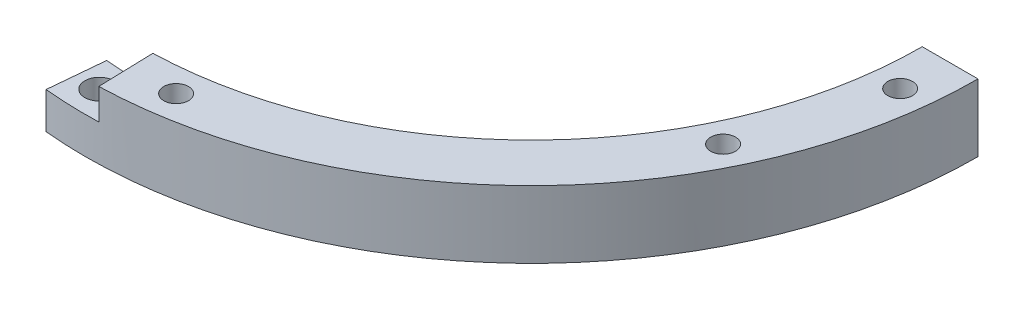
ISO-10303-21;
HEADER;
FILE_DESCRIPTION(('STEP AP214'),'2;1');
FILE_NAME('part.step','',(''),(''),'','','');
FILE_SCHEMA(('AUTOMOTIVE_DESIGN { 1 0 10303 214 1 1 1 1 }'));
ENDSEC;
DATA;
#1=APPLICATION_CONTEXT('core data for automotive mechanical design processes');
#2=APPLICATION_PROTOCOL_DEFINITION('international standard','automotive_design',2000,#1);
#3=PRODUCT_CONTEXT('',#1,'mechanical');
#4=PRODUCT('Part','Part','',(#3));
#5=PRODUCT_RELATED_PRODUCT_CATEGORY('part','',(#4));
#6=PRODUCT_DEFINITION_FORMATION('','',#4);
#7=PRODUCT_DEFINITION_CONTEXT('part definition',#1,'design');
#8=PRODUCT_DEFINITION('design','',#6,#7);
#9=PRODUCT_DEFINITION_SHAPE('','',#8);
#10=(LENGTH_UNIT() NAMED_UNIT(*) SI_UNIT(.MILLI.,.METRE.));
#11=(NAMED_UNIT(*) PLANE_ANGLE_UNIT() SI_UNIT($,.RADIAN.));
#12=(NAMED_UNIT(*) SI_UNIT($,.STERADIAN.) SOLID_ANGLE_UNIT());
#13=UNCERTAINTY_MEASURE_WITH_UNIT(LENGTH_MEASURE(1.E-05),#10,'distance_accuracy_value','');
#14=(GEOMETRIC_REPRESENTATION_CONTEXT(3) GLOBAL_UNCERTAINTY_ASSIGNED_CONTEXT((#13)) GLOBAL_UNIT_ASSIGNED_CONTEXT((#10,
#11,#12)) REPRESENTATION_CONTEXT('',''));
#15=CARTESIAN_POINT('',(0.,0.,0.));
#16=DIRECTION('',(0.,0.,1.));
#17=DIRECTION('',(1.,0.,0.));
#18=AXIS2_PLACEMENT_3D('',#15,#16,#17);
#19=CARTESIAN_POINT('',(0.,-44.6532,0.));
#20=DIRECTION('',(0.995724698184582,0.,0.0923705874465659));
#21=DIRECTION('',(0.0923705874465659,0.,-0.995724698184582));
#22=AXIS2_PLACEMENT_3D('',#19,#20,#21);
#23=PLANE('',#22);
#24=DIRECTION('',(-0.0923705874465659,0.,0.995724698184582));
#25=VECTOR('',#24,1.);
#26=CARTESIAN_POINT('',(0.,-39.8272,0.));
#27=LINE('',#26,#25);
#28=CARTESIAN_POINT('',(-4.76281222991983,-39.8272,51.3415568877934));
#29=VERTEX_POINT('',#28);
#30=CARTESIAN_POINT('',(-5.44321397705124,-39.8272,58.676065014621));
#31=VERTEX_POINT('',#30);
#32=EDGE_CURVE('E11',#29,#31,#27,.T.);
#33=ORIENTED_EDGE('',*,*,#32,.F.);
#34=DIRECTION('',(0.,1.,0.));
#35=VECTOR('',#34,1.);
#36=CARTESIAN_POINT('',(-4.76281222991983,0.,51.3415568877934));
#37=LINE('',#36,#35);
#38=CARTESIAN_POINT('',(-4.76281222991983,-44.6532,51.3415568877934));
#39=VERTEX_POINT('',#38);
#40=EDGE_CURVE('E52',#39,#29,#37,.T.);
#41=ORIENTED_EDGE('',*,*,#40,.F.);
#42=DIRECTION('',(0.0923705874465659,0.,-0.995724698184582));
#43=VECTOR('',#42,1.);
#44=CARTESIAN_POINT('',(0.,-44.6532,0.));
#45=LINE('',#44,#43);
#46=CARTESIAN_POINT('',(-5.44321397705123,-44.6532,58.676065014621));
#47=VERTEX_POINT('',#46);
#48=EDGE_CURVE('E159',#47,#39,#45,.T.);
#49=ORIENTED_EDGE('',*,*,#48,.F.);
#50=DIRECTION('',(0.,1.,0.));
#51=VECTOR('',#50,1.);
#52=CARTESIAN_POINT('',(-5.44321397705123,-44.6532,58.676065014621));
#53=LINE('',#52,#51);
#54=EDGE_CURVE('E38',#47,#31,#53,.T.);
#55=ORIENTED_EDGE('',*,*,#54,.T.);
#56=EDGE_LOOP('',(#33,#41,#49,#55));
#57=FACE_BOUND('',#56,.T.);
#58=ADVANCED_FACE('F30',(#57),#23,.F.);
#59=CARTESIAN_POINT('',(0.,0.,0.));
#60=DIRECTION('',(0.,1.,0.));
#61=DIRECTION('',(0.,0.,1.));
#62=AXIS2_PLACEMENT_3D('',#59,#60,#61);
#63=CYLINDRICAL_SURFACE('',#62,58.928);
#64=CARTESIAN_POINT('',(0.,-35.7632,0.));
#65=DIRECTION('',(0.,1.,0.));
#66=DIRECTION('',(0.,0.,1.));
#67=AXIS2_PLACEMENT_3D('',#64,#65,#66);
#68=CIRCLE('',#67,58.928);
#69=CARTESIAN_POINT('',(1.7481724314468,-35.7632,58.9020634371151));
#70=VERTEX_POINT('',#69);
#71=CARTESIAN_POINT('',(58.928,-35.7632,0.));
#72=VERTEX_POINT('',#71);
#73=EDGE_CURVE('E97',#70,#72,#68,.T.);
#74=ORIENTED_EDGE('',*,*,#73,.F.);
#75=DIRECTION('',(0.,1.,0.));
#76=VECTOR('',#75,1.);
#77=CARTESIAN_POINT('',(1.7481724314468,-39.8272,58.9020634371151));
#78=LINE('',#77,#76);
#79=CARTESIAN_POINT('',(1.7481724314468,-39.8272,58.9020634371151));
#80=VERTEX_POINT('',#79);
#81=EDGE_CURVE('E83',#80,#70,#78,.T.);
#82=ORIENTED_EDGE('',*,*,#81,.F.);
#83=CARTESIAN_POINT('',(0.,-39.8272,0.));
#84=DIRECTION('',(0.,1.,0.));
#85=DIRECTION('',(0.,0.,1.));
#86=AXIS2_PLACEMENT_3D('',#83,#84,#85);
#87=CIRCLE('',#86,58.928);
#88=EDGE_CURVE('E100',#31,#80,#87,.T.);
#89=ORIENTED_EDGE('',*,*,#88,.F.);
#90=ORIENTED_EDGE('',*,*,#54,.F.);
#91=CARTESIAN_POINT('',(0.,-44.6532,0.));
#92=DIRECTION('',(0.,1.,0.));
#93=DIRECTION('',(0.,0.,1.));
#94=AXIS2_PLACEMENT_3D('',#91,#92,#93);
#95=CIRCLE('',#94,58.928);
#96=CARTESIAN_POINT('',(58.928,-44.6532,0.));
#97=VERTEX_POINT('',#96);
#98=EDGE_CURVE('E118',#47,#97,#95,.T.);
#99=ORIENTED_EDGE('',*,*,#98,.T.);
#100=DIRECTION('',(0.,1.,0.));
#101=VECTOR('',#100,1.);
#102=CARTESIAN_POINT('',(58.928,-35.7632,0.));
#103=LINE('',#102,#101);
#104=EDGE_CURVE('E105',#97,#72,#103,.T.);
#105=ORIENTED_EDGE('',*,*,#104,.T.);
#106=EDGE_LOOP('',(#74,#82,#89,#90,#99,#105));
#107=FACE_BOUND('',#106,.T.);
#108=ADVANCED_FACE('F32',(#107),#63,.T.);
#109=CARTESIAN_POINT('',(20.1545630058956,-44.6532,-55.3742067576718));
#110=DIRECTION('',(0.,1.,0.));
#111=DIRECTION('',(0.,0.,1.));
#112=AXIS2_PLACEMENT_3D('',#109,#110,#111);
#113=PLANE('',#112);
#114=CARTESIAN_POINT('',(-1.95678154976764,-44.6532,55.1076852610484));
#115=DIRECTION('',(0.,1.,0.));
#116=DIRECTION('',(0.,0.,1.));
#117=AXIS2_PLACEMENT_3D('',#114,#115,#116);
#118=CIRCLE('',#117,1.9304);
#119=CARTESIAN_POINT('',(-1.95678154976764,-44.6532,57.0380852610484));
#120=VERTEX_POINT('',#119);
#121=EDGE_CURVE('E200',#120,#120,#118,.T.);
#122=ORIENTED_EDGE('',*,*,#121,.T.);
#123=EDGE_LOOP('',(#122));
#124=FACE_BOUND('',#123,.T.);
#125=CARTESIAN_POINT('',(54.8903557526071,-44.6532,6.24094753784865));
#126=DIRECTION('',(0.,-1.,0.));
#127=DIRECTION('',(0.,0.,-1.));
#128=AXIS2_PLACEMENT_3D('',#125,#126,#127);
#129=CIRCLE('',#128,2.77876);
#130=CARTESIAN_POINT('',(54.8903557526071,-44.6532,3.46218753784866));
#131=VERTEX_POINT('',#130);
#132=EDGE_CURVE('E127',#131,#131,#129,.T.);
#133=ORIENTED_EDGE('',*,*,#132,.F.);
#134=EDGE_LOOP('',(#133));
#135=FACE_BOUND('',#134,.T.);
#136=CARTESIAN_POINT('',(49.5649940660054,-44.6532,24.2884214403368));
#137=DIRECTION('',(0.,-1.,0.));
#138=DIRECTION('',(0.,0.,-1.));
#139=AXIS2_PLACEMENT_3D('',#136,#137,#138);
#140=CIRCLE('',#139,2.77876);
#141=CARTESIAN_POINT('',(49.5649940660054,-44.6532,21.5096614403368));
#142=VERTEX_POINT('',#141);
#143=EDGE_CURVE('E123',#142,#142,#140,.T.);
#144=ORIENTED_EDGE('',*,*,#143,.F.);
#145=EDGE_LOOP('',(#144));
#146=FACE_BOUND('',#145,.T.);
#147=CARTESIAN_POINT('',(7.67585294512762,-44.6532,54.6165316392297));
#148=DIRECTION('',(0.,-1.,0.));
#149=DIRECTION('',(0.,0.,-1.));
#150=AXIS2_PLACEMENT_3D('',#147,#148,#149);
#151=CIRCLE('',#150,2.77876);
#152=CARTESIAN_POINT('',(7.67585294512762,-44.6532,51.8377716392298));
#153=VERTEX_POINT('',#152);
#154=EDGE_CURVE('E119',#153,#153,#151,.T.);
#155=ORIENTED_EDGE('',*,*,#154,.F.);
#156=EDGE_LOOP('',(#155));
#157=FACE_BOUND('',#156,.T.);
#158=ORIENTED_EDGE('',*,*,#98,.F.);
#159=ORIENTED_EDGE('',*,*,#48,.T.);
#160=CARTESIAN_POINT('',(0.,-44.6532,0.));
#161=DIRECTION('',(0.,1.,0.));
#162=DIRECTION('',(0.,0.,1.));
#163=AXIS2_PLACEMENT_3D('',#160,#161,#162);
#164=CIRCLE('',#163,51.562);
#165=CARTESIAN_POINT('',(51.562,-44.6532,0.));
#166=VERTEX_POINT('',#165);
#167=EDGE_CURVE('E156',#39,#166,#164,.T.);
#168=ORIENTED_EDGE('',*,*,#167,.T.);
#169=DIRECTION('',(1.,0.,0.));
#170=VECTOR('',#169,1.);
#171=CARTESIAN_POINT('',(58.928,-44.6532,0.));
#172=LINE('',#171,#170);
#173=EDGE_CURVE('E154',#166,#97,#172,.T.);
#174=ORIENTED_EDGE('',*,*,#173,.T.);
#175=EDGE_LOOP('',(#158,#159,#168,#174));
#176=FACE_BOUND('',#175,.T.);
#177=ADVANCED_FACE('F167',(#124,#135,#146,#157,#176),#113,.F.);
#178=CARTESIAN_POINT('',(0.,0.,0.));
#179=DIRECTION('',(0.,1.,0.));
#180=DIRECTION('',(0.,0.,1.));
#181=AXIS2_PLACEMENT_3D('',#178,#179,#180);
#182=CYLINDRICAL_SURFACE('',#181,51.562);
#183=CARTESIAN_POINT('',(0.,-39.8272,0.));
#184=DIRECTION('',(0.,1.,0.));
#185=DIRECTION('',(0.,0.,1.));
#186=AXIS2_PLACEMENT_3D('',#183,#184,#185);
#187=CIRCLE('',#186,51.562);
#188=CARTESIAN_POINT('',(1.52965087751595,-39.8272,51.5393055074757));
#189=VERTEX_POINT('',#188);
#190=EDGE_CURVE('E44',#189,#29,#187,.F.);
#191=ORIENTED_EDGE('',*,*,#190,.F.);
#192=DIRECTION('',(0.,1.,0.));
#193=VECTOR('',#192,1.);
#194=CARTESIAN_POINT('',(1.52965087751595,0.,51.5393055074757));
#195=LINE('',#194,#193);
#196=CARTESIAN_POINT('',(1.52965087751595,-35.7632,51.5393055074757));
#197=VERTEX_POINT('',#196);
#198=EDGE_CURVE('E260',#189,#197,#195,.T.);
#199=ORIENTED_EDGE('',*,*,#198,.T.);
#200=CARTESIAN_POINT('',(0.,-35.7632,0.));
#201=DIRECTION('',(0.,1.,0.));
#202=DIRECTION('',(0.,0.,1.));
#203=AXIS2_PLACEMENT_3D('',#200,#201,#202);
#204=CIRCLE('',#203,51.562);
#205=CARTESIAN_POINT('',(51.562,-35.7632,0.));
#206=VERTEX_POINT('',#205);
#207=EDGE_CURVE('E99',#197,#206,#204,.T.);
#208=ORIENTED_EDGE('',*,*,#207,.T.);
#209=DIRECTION('',(0.,-1.,0.));
#210=VECTOR('',#209,1.);
#211=CARTESIAN_POINT('',(51.562,-35.7632,0.));
#212=LINE('',#211,#210);
#213=EDGE_CURVE('E107',#206,#166,#212,.T.);
#214=ORIENTED_EDGE('',*,*,#213,.T.);
#215=ORIENTED_EDGE('',*,*,#167,.F.);
#216=ORIENTED_EDGE('',*,*,#40,.T.);
#217=EDGE_LOOP('',(#191,#199,#208,#214,#215,#216));
#218=FACE_BOUND('',#217,.T.);
#219=ADVANCED_FACE('F171',(#218),#182,.F.);
#220=CARTESIAN_POINT('',(20.1545630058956,-35.7632,-55.3742067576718));
#221=DIRECTION('',(0.,-1.,0.));
#222=DIRECTION('',(0.,0.,-1.));
#223=AXIS2_PLACEMENT_3D('',#220,#221,#222);
#224=PLANE('',#223);
#225=CARTESIAN_POINT('',(54.8903557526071,-35.7632,6.24094753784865));
#226=DIRECTION('',(0.,-1.,0.));
#227=DIRECTION('',(0.,0.,-1.));
#228=AXIS2_PLACEMENT_3D('',#225,#226,#227);
#229=CIRCLE('',#228,1.63195);
#230=CARTESIAN_POINT('',(54.8903557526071,-35.7632,4.60899753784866));
#231=VERTEX_POINT('',#230);
#232=EDGE_CURVE('E124',#231,#231,#229,.T.);
#233=ORIENTED_EDGE('',*,*,#232,.T.);
#234=EDGE_LOOP('',(#233));
#235=FACE_BOUND('',#234,.T.);
#236=CARTESIAN_POINT('',(49.5649940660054,-35.7632,24.2884214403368));
#237=DIRECTION('',(0.,-1.,0.));
#238=DIRECTION('',(0.,0.,-1.));
#239=AXIS2_PLACEMENT_3D('',#236,#237,#238);
#240=CIRCLE('',#239,1.63195);
#241=CARTESIAN_POINT('',(49.5649940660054,-35.7632,22.6564714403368));
#242=VERTEX_POINT('',#241);
#243=EDGE_CURVE('E120',#242,#242,#240,.T.);
#244=ORIENTED_EDGE('',*,*,#243,.T.);
#245=EDGE_LOOP('',(#244));
#246=FACE_BOUND('',#245,.T.);
#247=CARTESIAN_POINT('',(7.67585294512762,-35.7632,54.6165316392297));
#248=DIRECTION('',(0.,-1.,0.));
#249=DIRECTION('',(0.,0.,-1.));
#250=AXIS2_PLACEMENT_3D('',#247,#248,#249);
#251=CIRCLE('',#250,1.63195);
#252=CARTESIAN_POINT('',(7.67585294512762,-35.7632,52.9845816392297));
#253=VERTEX_POINT('',#252);
#254=EDGE_CURVE('E115',#253,#253,#251,.T.);
#255=ORIENTED_EDGE('',*,*,#254,.T.);
#256=EDGE_LOOP('',(#255));
#257=FACE_BOUND('',#256,.T.);
#258=ORIENTED_EDGE('',*,*,#207,.F.);
#259=DIRECTION('',(-0.0296662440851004,0.,-0.999559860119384));
#260=VECTOR('',#259,1.);
#261=CARTESIAN_POINT('',(0.,-35.7632,0.));
#262=LINE('',#261,#260);
#263=EDGE_CURVE('E86',#70,#197,#262,.T.);
#264=ORIENTED_EDGE('',*,*,#263,.F.);
#265=ORIENTED_EDGE('',*,*,#73,.T.);
#266=DIRECTION('',(-1.,0.,0.));
#267=VECTOR('',#266,1.);
#268=CARTESIAN_POINT('',(58.928,-35.7632,0.));
#269=LINE('',#268,#267);
#270=EDGE_CURVE('E106',#72,#206,#269,.T.);
#271=ORIENTED_EDGE('',*,*,#270,.T.);
#272=EDGE_LOOP('',(#258,#264,#265,#271));
#273=FACE_BOUND('',#272,.T.);
#274=ADVANCED_FACE('F95',(#235,#246,#257,#273),#224,.F.);
#275=CARTESIAN_POINT('',(58.928,-44.6532,0.));
#276=DIRECTION('',(0.,0.,-1.));
#277=DIRECTION('',(-1.,0.,0.));
#278=AXIS2_PLACEMENT_3D('',#275,#276,#277);
#279=PLANE('',#278);
#280=ORIENTED_EDGE('',*,*,#104,.F.);
#281=ORIENTED_EDGE('',*,*,#173,.F.);
#282=ORIENTED_EDGE('',*,*,#213,.F.);
#283=ORIENTED_EDGE('',*,*,#270,.F.);
#284=EDGE_LOOP('',(#280,#281,#282,#283));
#285=FACE_BOUND('',#284,.T.);
#286=ADVANCED_FACE('F173',(#285),#279,.T.);
#287=CARTESIAN_POINT('',(7.67585294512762,-44.6532,54.6165316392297));
#288=DIRECTION('',(0.,-1.,0.));
#289=DIRECTION('',(0.,0.,-1.));
#290=AXIS2_PLACEMENT_3D('',#287,#288,#289);
#291=CYLINDRICAL_SURFACE('',#290,1.63195);
#292=CARTESIAN_POINT('',(7.67585294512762,-40.2082,54.6165316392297));
#293=DIRECTION('',(0.,-1.,0.));
#294=DIRECTION('',(0.,0.,-1.));
#295=AXIS2_PLACEMENT_3D('',#292,#293,#294);
#296=CIRCLE('',#295,1.63195);
#297=CARTESIAN_POINT('',(7.67585294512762,-40.2082,52.9845816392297));
#298=VERTEX_POINT('',#297);
#299=EDGE_CURVE('E122',#298,#298,#296,.T.);
#300=ORIENTED_EDGE('',*,*,#299,.T.);
#301=EDGE_LOOP('',(#300));
#302=FACE_BOUND('',#301,.T.);
#303=ORIENTED_EDGE('',*,*,#254,.F.);
#304=EDGE_LOOP('',(#303));
#305=FACE_BOUND('',#304,.T.);
#306=ADVANCED_FACE('F175',(#302,#305),#291,.F.);
#307=CARTESIAN_POINT('',(7.67585294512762,-44.6532,54.6165316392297));
#308=DIRECTION('',(0.,-1.,0.));
#309=DIRECTION('',(0.,0.,-1.));
#310=AXIS2_PLACEMENT_3D('',#307,#308,#309);
#311=CYLINDRICAL_SURFACE('',#310,2.77876);
#312=CARTESIAN_POINT('',(7.67585294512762,-40.2082,54.6165316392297));
#313=DIRECTION('',(0.,-1.,0.));
#314=DIRECTION('',(0.,0.,-1.));
#315=AXIS2_PLACEMENT_3D('',#312,#313,#314);
#316=CIRCLE('',#315,2.77876);
#317=CARTESIAN_POINT('',(7.67585294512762,-40.2082,51.8377716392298));
#318=VERTEX_POINT('',#317);
#319=EDGE_CURVE('E149',#318,#318,#316,.T.);
#320=ORIENTED_EDGE('',*,*,#319,.F.);
#321=EDGE_LOOP('',(#320));
#322=FACE_BOUND('',#321,.T.);
#323=ORIENTED_EDGE('',*,*,#154,.T.);
#324=EDGE_LOOP('',(#323));
#325=FACE_BOUND('',#324,.T.);
#326=ADVANCED_FACE('F181',(#322,#325),#311,.F.);
#327=CARTESIAN_POINT('',(9.30780294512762,-40.2082,54.6165316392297));
#328=DIRECTION('',(0.,1.,0.));
#329=DIRECTION('',(0.,0.,1.));
#330=AXIS2_PLACEMENT_3D('',#327,#328,#329);
#331=PLANE('',#330);
#332=ORIENTED_EDGE('',*,*,#299,.F.);
#333=EDGE_LOOP('',(#332));
#334=FACE_BOUND('',#333,.T.);
#335=ORIENTED_EDGE('',*,*,#319,.T.);
#336=EDGE_LOOP('',(#335));
#337=FACE_BOUND('',#336,.T.);
#338=ADVANCED_FACE('F207',(#334,#337),#331,.F.);
#339=CARTESIAN_POINT('',(49.5649940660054,-44.6532,24.2884214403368));
#340=DIRECTION('',(0.,-1.,0.));
#341=DIRECTION('',(0.,0.,-1.));
#342=AXIS2_PLACEMENT_3D('',#339,#340,#341);
#343=CYLINDRICAL_SURFACE('',#342,1.63195);
#344=CARTESIAN_POINT('',(49.5649940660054,-40.2082,24.2884214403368));
#345=DIRECTION('',(0.,-1.,0.));
#346=DIRECTION('',(0.,0.,-1.));
#347=AXIS2_PLACEMENT_3D('',#344,#345,#346);
#348=CIRCLE('',#347,1.63195);
#349=CARTESIAN_POINT('',(49.5649940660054,-40.2082,22.6564714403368));
#350=VERTEX_POINT('',#349);
#351=EDGE_CURVE('E126',#350,#350,#348,.T.);
#352=ORIENTED_EDGE('',*,*,#351,.T.);
#353=EDGE_LOOP('',(#352));
#354=FACE_BOUND('',#353,.T.);
#355=ORIENTED_EDGE('',*,*,#243,.F.);
#356=EDGE_LOOP('',(#355));
#357=FACE_BOUND('',#356,.T.);
#358=ADVANCED_FACE('F212',(#354,#357),#343,.F.);
#359=CARTESIAN_POINT('',(49.5649940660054,-44.6532,24.2884214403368));
#360=DIRECTION('',(0.,-1.,0.));
#361=DIRECTION('',(0.,0.,-1.));
#362=AXIS2_PLACEMENT_3D('',#359,#360,#361);
#363=CYLINDRICAL_SURFACE('',#362,2.77876);
#364=CARTESIAN_POINT('',(49.5649940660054,-40.2082,24.2884214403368));
#365=DIRECTION('',(0.,-1.,0.));
#366=DIRECTION('',(0.,0.,-1.));
#367=AXIS2_PLACEMENT_3D('',#364,#365,#366);
#368=CIRCLE('',#367,2.77876);
#369=CARTESIAN_POINT('',(49.5649940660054,-40.2082,21.5096614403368));
#370=VERTEX_POINT('',#369);
#371=EDGE_CURVE('E131',#370,#370,#368,.T.);
#372=ORIENTED_EDGE('',*,*,#371,.F.);
#373=EDGE_LOOP('',(#372));
#374=FACE_BOUND('',#373,.T.);
#375=ORIENTED_EDGE('',*,*,#143,.T.);
#376=EDGE_LOOP('',(#375));
#377=FACE_BOUND('',#376,.T.);
#378=ADVANCED_FACE('F217',(#374,#377),#363,.F.);
#379=CARTESIAN_POINT('',(51.1969440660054,-40.2082,24.2884214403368));
#380=DIRECTION('',(0.,1.,0.));
#381=DIRECTION('',(0.,0.,1.));
#382=AXIS2_PLACEMENT_3D('',#379,#380,#381);
#383=PLANE('',#382);
#384=ORIENTED_EDGE('',*,*,#351,.F.);
#385=EDGE_LOOP('',(#384));
#386=FACE_BOUND('',#385,.T.);
#387=ORIENTED_EDGE('',*,*,#371,.T.);
#388=EDGE_LOOP('',(#387));
#389=FACE_BOUND('',#388,.T.);
#390=ADVANCED_FACE('F220',(#386,#389),#383,.F.);
#391=CARTESIAN_POINT('',(54.8903557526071,-44.6532,6.24094753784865));
#392=DIRECTION('',(0.,-1.,0.));
#393=DIRECTION('',(0.,0.,-1.));
#394=AXIS2_PLACEMENT_3D('',#391,#392,#393);
#395=CYLINDRICAL_SURFACE('',#394,1.63195);
#396=CARTESIAN_POINT('',(54.8903557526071,-40.2082,6.24094753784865));
#397=DIRECTION('',(0.,-1.,0.));
#398=DIRECTION('',(0.,0.,-1.));
#399=AXIS2_PLACEMENT_3D('',#396,#397,#398);
#400=CIRCLE('',#399,1.63195);
#401=CARTESIAN_POINT('',(54.8903557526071,-40.2082,4.60899753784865));
#402=VERTEX_POINT('',#401);
#403=EDGE_CURVE('E139',#402,#402,#400,.T.);
#404=ORIENTED_EDGE('',*,*,#403,.T.);
#405=EDGE_LOOP('',(#404));
#406=FACE_BOUND('',#405,.T.);
#407=ORIENTED_EDGE('',*,*,#232,.F.);
#408=EDGE_LOOP('',(#407));
#409=FACE_BOUND('',#408,.T.);
#410=ADVANCED_FACE('F224',(#406,#409),#395,.F.);
#411=CARTESIAN_POINT('',(54.8903557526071,-44.6532,6.24094753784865));
#412=DIRECTION('',(0.,-1.,0.));
#413=DIRECTION('',(0.,0.,-1.));
#414=AXIS2_PLACEMENT_3D('',#411,#412,#413);
#415=CYLINDRICAL_SURFACE('',#414,2.77876);
#416=CARTESIAN_POINT('',(54.8903557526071,-40.2082,6.24094753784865));
#417=DIRECTION('',(0.,-1.,0.));
#418=DIRECTION('',(0.,0.,-1.));
#419=AXIS2_PLACEMENT_3D('',#416,#417,#418);
#420=CIRCLE('',#419,2.77876);
#421=CARTESIAN_POINT('',(54.8903557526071,-40.2082,3.46218753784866));
#422=VERTEX_POINT('',#421);
#423=EDGE_CURVE('E134',#422,#422,#420,.T.);
#424=ORIENTED_EDGE('',*,*,#423,.F.);
#425=EDGE_LOOP('',(#424));
#426=FACE_BOUND('',#425,.T.);
#427=ORIENTED_EDGE('',*,*,#132,.T.);
#428=EDGE_LOOP('',(#427));
#429=FACE_BOUND('',#428,.T.);
#430=ADVANCED_FACE('F229',(#426,#429),#415,.F.);
#431=CARTESIAN_POINT('',(56.5223057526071,-40.2082,6.24094753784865));
#432=DIRECTION('',(0.,1.,0.));
#433=DIRECTION('',(0.,0.,1.));
#434=AXIS2_PLACEMENT_3D('',#431,#432,#433);
#435=PLANE('',#434);
#436=ORIENTED_EDGE('',*,*,#403,.F.);
#437=EDGE_LOOP('',(#436));
#438=FACE_BOUND('',#437,.T.);
#439=ORIENTED_EDGE('',*,*,#423,.T.);
#440=EDGE_LOOP('',(#439));
#441=FACE_BOUND('',#440,.T.);
#442=ADVANCED_FACE('F232',(#438,#441),#435,.F.);
#443=CARTESIAN_POINT('',(0.,-39.8272,0.));
#444=DIRECTION('',(0.999559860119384,0.,-0.0296662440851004));
#445=DIRECTION('',(-0.0296662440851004,0.,-0.999559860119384));
#446=AXIS2_PLACEMENT_3D('',#443,#444,#445);
#447=PLANE('',#446);
#448=DIRECTION('',(-0.0296662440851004,0.,-0.999559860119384));
#449=VECTOR('',#448,1.);
#450=CARTESIAN_POINT('',(0.,-39.8272,0.));
#451=LINE('',#450,#449);
#452=EDGE_CURVE('E88',#80,#189,#451,.T.);
#453=ORIENTED_EDGE('',*,*,#452,.F.);
#454=ORIENTED_EDGE('',*,*,#81,.T.);
#455=ORIENTED_EDGE('',*,*,#263,.T.);
#456=ORIENTED_EDGE('',*,*,#198,.F.);
#457=EDGE_LOOP('',(#453,#454,#455,#456));
#458=FACE_BOUND('',#457,.T.);
#459=ADVANCED_FACE('F85',(#458),#447,.F.);
#460=CARTESIAN_POINT('',(0.,-39.8272,0.));
#461=DIRECTION('',(0.,1.,0.));
#462=DIRECTION('',(0.,0.,1.));
#463=AXIS2_PLACEMENT_3D('',#460,#461,#462);
#464=PLANE('',#463);
#465=CARTESIAN_POINT('',(-1.95678154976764,-39.8272,55.1076852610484));
#466=DIRECTION('',(0.,1.,0.));
#467=DIRECTION('',(0.,0.,1.));
#468=AXIS2_PLACEMENT_3D('',#465,#466,#467);
#469=CIRCLE('',#468,1.9304);
#470=CARTESIAN_POINT('',(-1.95678154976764,-39.8272,57.0380852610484));
#471=VERTEX_POINT('',#470);
#472=EDGE_CURVE('E101',#471,#471,#469,.T.);
#473=ORIENTED_EDGE('',*,*,#472,.F.);
#474=EDGE_LOOP('',(#473));
#475=FACE_BOUND('',#474,.T.);
#476=ORIENTED_EDGE('',*,*,#190,.T.);
#477=ORIENTED_EDGE('',*,*,#32,.T.);
#478=ORIENTED_EDGE('',*,*,#88,.T.);
#479=ORIENTED_EDGE('',*,*,#452,.T.);
#480=EDGE_LOOP('',(#476,#477,#478,#479));
#481=FACE_BOUND('',#480,.T.);
#482=ADVANCED_FACE('F242',(#475,#481),#464,.T.);
#483=CARTESIAN_POINT('',(-1.95678154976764,-39.8272,55.1076852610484));
#484=DIRECTION('',(0.,1.,0.));
#485=DIRECTION('',(0.,0.,1.));
#486=AXIS2_PLACEMENT_3D('',#483,#484,#485);
#487=CYLINDRICAL_SURFACE('',#486,1.9304);
#488=ORIENTED_EDGE('',*,*,#121,.F.);
#489=EDGE_LOOP('',(#488));
#490=FACE_BOUND('',#489,.T.);
#491=ORIENTED_EDGE('',*,*,#472,.T.);
#492=EDGE_LOOP('',(#491));
#493=FACE_BOUND('',#492,.T.);
#494=ADVANCED_FACE('F245',(#490,#493),#487,.F.);
#495=CLOSED_SHELL('',(#58,#108,#177,#219,#274,#286,#306,#326,#338,#358,#378,#390,#410,#430,#442,
#459,#482,#494));
#496=MANIFOLD_SOLID_BREP('B2',#495);
#497=ADVANCED_BREP_SHAPE_REPRESENTATION('',(#18,#496),#14);
#498=SHAPE_DEFINITION_REPRESENTATION(#9,#497);
ENDSEC;
END-ISO-10303-21;
